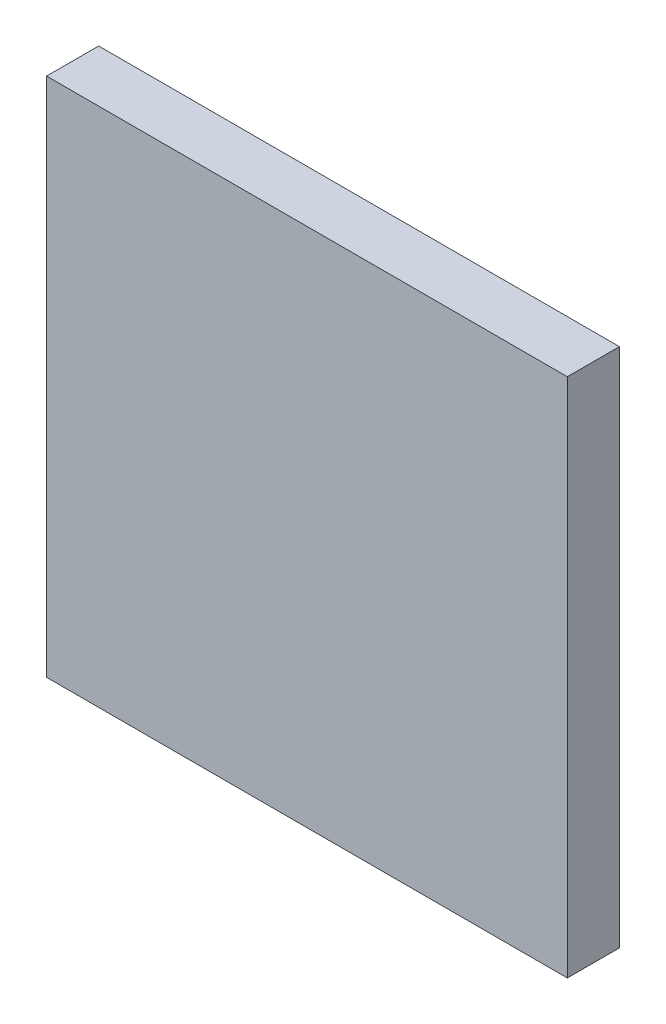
ISO-10303-21;
HEADER;
FILE_DESCRIPTION(('STEP AP214'),'2;1');
FILE_NAME('part.step','',(''),(''),'','','');
FILE_SCHEMA(('AUTOMOTIVE_DESIGN { 1 0 10303 214 1 1 1 1 }'));
ENDSEC;
DATA;
#1=APPLICATION_CONTEXT('core data for automotive mechanical design processes');
#2=APPLICATION_PROTOCOL_DEFINITION('international standard','automotive_design',2000,#1);
#3=PRODUCT_CONTEXT('',#1,'mechanical');
#4=PRODUCT('Part','Part','',(#3));
#5=PRODUCT_RELATED_PRODUCT_CATEGORY('part','',(#4));
#6=PRODUCT_DEFINITION_FORMATION('','',#4);
#7=PRODUCT_DEFINITION_CONTEXT('part definition',#1,'design');
#8=PRODUCT_DEFINITION('design','',#6,#7);
#9=PRODUCT_DEFINITION_SHAPE('','',#8);
#10=(LENGTH_UNIT() NAMED_UNIT(*) SI_UNIT(.MILLI.,.METRE.));
#11=(NAMED_UNIT(*) PLANE_ANGLE_UNIT() SI_UNIT($,.RADIAN.));
#12=(NAMED_UNIT(*) SI_UNIT($,.STERADIAN.) SOLID_ANGLE_UNIT());
#13=UNCERTAINTY_MEASURE_WITH_UNIT(LENGTH_MEASURE(1.E-05),#10,'distance_accuracy_value','');
#14=(GEOMETRIC_REPRESENTATION_CONTEXT(3) GLOBAL_UNCERTAINTY_ASSIGNED_CONTEXT((#13)) GLOBAL_UNIT_ASSIGNED_CONTEXT((#10,
#11,#12)) REPRESENTATION_CONTEXT('',''));
#15=CARTESIAN_POINT('',(0.,0.,0.));
#16=DIRECTION('',(0.,0.,1.));
#17=DIRECTION('',(1.,0.,0.));
#18=AXIS2_PLACEMENT_3D('',#15,#16,#17);
#19=CARTESIAN_POINT('',(77.3591990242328,-219.871011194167,12.7));
#20=DIRECTION('',(-1.,0.,0.));
#21=DIRECTION('',(0.,0.,1.));
#22=AXIS2_PLACEMENT_3D('',#19,#20,#21);
#23=PLANE('',#22);
#24=DIRECTION('',(0.,1.,0.));
#25=VECTOR('',#24,1.);
#26=CARTESIAN_POINT('',(77.3591990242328,-219.871011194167,0.));
#27=LINE('',#26,#25);
#28=CARTESIAN_POINT('',(77.3591990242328,-219.871011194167,0.));
#29=VERTEX_POINT('',#28);
#30=CARTESIAN_POINT('',(77.3591990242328,-92.8710111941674,0.));
#31=VERTEX_POINT('',#30);
#32=EDGE_CURVE('E98',#29,#31,#27,.T.);
#33=ORIENTED_EDGE('',*,*,#32,.T.);
#34=DIRECTION('',(0.,0.,-1.));
#35=VECTOR('',#34,1.);
#36=CARTESIAN_POINT('',(77.3591990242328,-92.8710111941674,12.7));
#37=LINE('',#36,#35);
#38=CARTESIAN_POINT('',(77.3591990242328,-92.8710111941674,12.7));
#39=VERTEX_POINT('',#38);
#40=EDGE_CURVE('E11',#39,#31,#37,.T.);
#41=ORIENTED_EDGE('',*,*,#40,.F.);
#42=DIRECTION('',(0.,1.,0.));
#43=VECTOR('',#42,1.);
#44=CARTESIAN_POINT('',(77.3591990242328,-219.871011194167,12.7));
#45=LINE('',#44,#43);
#46=CARTESIAN_POINT('',(77.3591990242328,-219.871011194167,12.7));
#47=VERTEX_POINT('',#46);
#48=EDGE_CURVE('E86',#47,#39,#45,.T.);
#49=ORIENTED_EDGE('',*,*,#48,.F.);
#50=DIRECTION('',(0.,0.,-1.));
#51=VECTOR('',#50,1.);
#52=CARTESIAN_POINT('',(77.3591990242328,-219.871011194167,12.7));
#53=LINE('',#52,#51);
#54=EDGE_CURVE('E94',#47,#29,#53,.T.);
#55=ORIENTED_EDGE('',*,*,#54,.T.);
#56=EDGE_LOOP('',(#33,#41,#49,#55));
#57=FACE_BOUND('',#56,.T.);
#58=ADVANCED_FACE('F35',(#57),#23,.F.);
#59=CARTESIAN_POINT('',(77.3591990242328,-92.8710111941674,12.7));
#60=DIRECTION('',(0.,-1.,0.));
#61=DIRECTION('',(1.,0.,0.));
#62=AXIS2_PLACEMENT_3D('',#59,#60,#61);
#63=PLANE('',#62);
#64=DIRECTION('',(-1.,0.,0.));
#65=VECTOR('',#64,1.);
#66=CARTESIAN_POINT('',(77.3591990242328,-92.8710111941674,0.));
#67=LINE('',#66,#65);
#68=CARTESIAN_POINT('',(-49.6408009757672,-92.8710111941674,0.));
#69=VERTEX_POINT('',#68);
#70=EDGE_CURVE('E90',#31,#69,#67,.T.);
#71=ORIENTED_EDGE('',*,*,#70,.T.);
#72=DIRECTION('',(0.,0.,-1.));
#73=VECTOR('',#72,1.);
#74=CARTESIAN_POINT('',(-49.6408009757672,-92.8710111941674,12.7));
#75=LINE('',#74,#73);
#76=CARTESIAN_POINT('',(-49.6408009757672,-92.8710111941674,12.7));
#77=VERTEX_POINT('',#76);
#78=EDGE_CURVE('E43',#77,#69,#75,.T.);
#79=ORIENTED_EDGE('',*,*,#78,.F.);
#80=DIRECTION('',(-1.,0.,0.));
#81=VECTOR('',#80,1.);
#82=CARTESIAN_POINT('',(77.3591990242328,-92.8710111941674,12.7));
#83=LINE('',#82,#81);
#84=EDGE_CURVE('E81',#39,#77,#83,.T.);
#85=ORIENTED_EDGE('',*,*,#84,.F.);
#86=ORIENTED_EDGE('',*,*,#40,.T.);
#87=EDGE_LOOP('',(#71,#79,#85,#86));
#88=FACE_BOUND('',#87,.T.);
#89=ADVANCED_FACE('F89',(#88),#63,.F.);
#90=CARTESIAN_POINT('',(-49.6408009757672,-219.871011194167,12.7));
#91=DIRECTION('',(1.,0.,0.));
#92=DIRECTION('',(0.,0.,-1.));
#93=AXIS2_PLACEMENT_3D('',#90,#91,#92);
#94=PLANE('',#93);
#95=DIRECTION('',(0.,-1.,0.));
#96=VECTOR('',#95,1.);
#97=CARTESIAN_POINT('',(-49.6408009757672,-219.871011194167,0.));
#98=LINE('',#97,#96);
#99=CARTESIAN_POINT('',(-49.6408009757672,-219.871011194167,0.));
#100=VERTEX_POINT('',#99);
#101=EDGE_CURVE('E68',#69,#100,#98,.T.);
#102=ORIENTED_EDGE('',*,*,#101,.T.);
#103=DIRECTION('',(0.,0.,-1.));
#104=VECTOR('',#103,1.);
#105=CARTESIAN_POINT('',(-49.6408009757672,-219.871011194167,12.7));
#106=LINE('',#105,#104);
#107=CARTESIAN_POINT('',(-49.6408009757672,-219.871011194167,12.7));
#108=VERTEX_POINT('',#107);
#109=EDGE_CURVE('E91',#108,#100,#106,.T.);
#110=ORIENTED_EDGE('',*,*,#109,.F.);
#111=DIRECTION('',(0.,-1.,0.));
#112=VECTOR('',#111,1.);
#113=CARTESIAN_POINT('',(-49.6408009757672,-219.871011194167,12.7));
#114=LINE('',#113,#112);
#115=EDGE_CURVE('E84',#77,#108,#114,.T.);
#116=ORIENTED_EDGE('',*,*,#115,.F.);
#117=ORIENTED_EDGE('',*,*,#78,.T.);
#118=EDGE_LOOP('',(#102,#110,#116,#117));
#119=FACE_BOUND('',#118,.T.);
#120=ADVANCED_FACE('F92',(#119),#94,.F.);
#121=CARTESIAN_POINT('',(77.3591990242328,-219.871011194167,12.7));
#122=DIRECTION('',(0.,1.,0.));
#123=DIRECTION('',(0.,0.,1.));
#124=AXIS2_PLACEMENT_3D('',#121,#122,#123);
#125=PLANE('',#124);
#126=DIRECTION('',(1.,0.,0.));
#127=VECTOR('',#126,1.);
#128=CARTESIAN_POINT('',(77.3591990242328,-219.871011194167,0.));
#129=LINE('',#128,#127);
#130=EDGE_CURVE('E74',#100,#29,#129,.T.);
#131=ORIENTED_EDGE('',*,*,#130,.T.);
#132=ORIENTED_EDGE('',*,*,#54,.F.);
#133=DIRECTION('',(1.,0.,0.));
#134=VECTOR('',#133,1.);
#135=CARTESIAN_POINT('',(77.3591990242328,-219.871011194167,12.7));
#136=LINE('',#135,#134);
#137=EDGE_CURVE('E51',#108,#47,#136,.T.);
#138=ORIENTED_EDGE('',*,*,#137,.F.);
#139=ORIENTED_EDGE('',*,*,#109,.T.);
#140=EDGE_LOOP('',(#131,#132,#138,#139));
#141=FACE_BOUND('',#140,.T.);
#142=ADVANCED_FACE('F105',(#141),#125,.F.);
#143=CARTESIAN_POINT('',(0.,0.,12.7));
#144=DIRECTION('',(0.,0.,1.));
#145=DIRECTION('',(1.,0.,0.));
#146=AXIS2_PLACEMENT_3D('',#143,#144,#145);
#147=PLANE('',#146);
#148=ORIENTED_EDGE('',*,*,#48,.T.);
#149=ORIENTED_EDGE('',*,*,#84,.T.);
#150=ORIENTED_EDGE('',*,*,#115,.T.);
#151=ORIENTED_EDGE('',*,*,#137,.T.);
#152=EDGE_LOOP('',(#148,#149,#150,#151));
#153=FACE_BOUND('',#152,.T.);
#154=ADVANCED_FACE('F82',(#153),#147,.T.);
#155=CARTESIAN_POINT('',(0.,0.,0.));
#156=DIRECTION('',(0.,0.,1.));
#157=DIRECTION('',(1.,0.,0.));
#158=AXIS2_PLACEMENT_3D('',#155,#156,#157);
#159=PLANE('',#158);
#160=ORIENTED_EDGE('',*,*,#32,.F.);
#161=ORIENTED_EDGE('',*,*,#130,.F.);
#162=ORIENTED_EDGE('',*,*,#101,.F.);
#163=ORIENTED_EDGE('',*,*,#70,.F.);
#164=EDGE_LOOP('',(#160,#161,#162,#163));
#165=FACE_BOUND('',#164,.T.);
#166=ADVANCED_FACE('F108',(#165),#159,.F.);
#167=CLOSED_SHELL('',(#58,#89,#120,#142,#154,#166));
#168=MANIFOLD_SOLID_BREP('B2',#167);
#169=ADVANCED_BREP_SHAPE_REPRESENTATION('',(#18,#168),#14);
#170=SHAPE_DEFINITION_REPRESENTATION(#9,#169);
ENDSEC;
END-ISO-10303-21;
